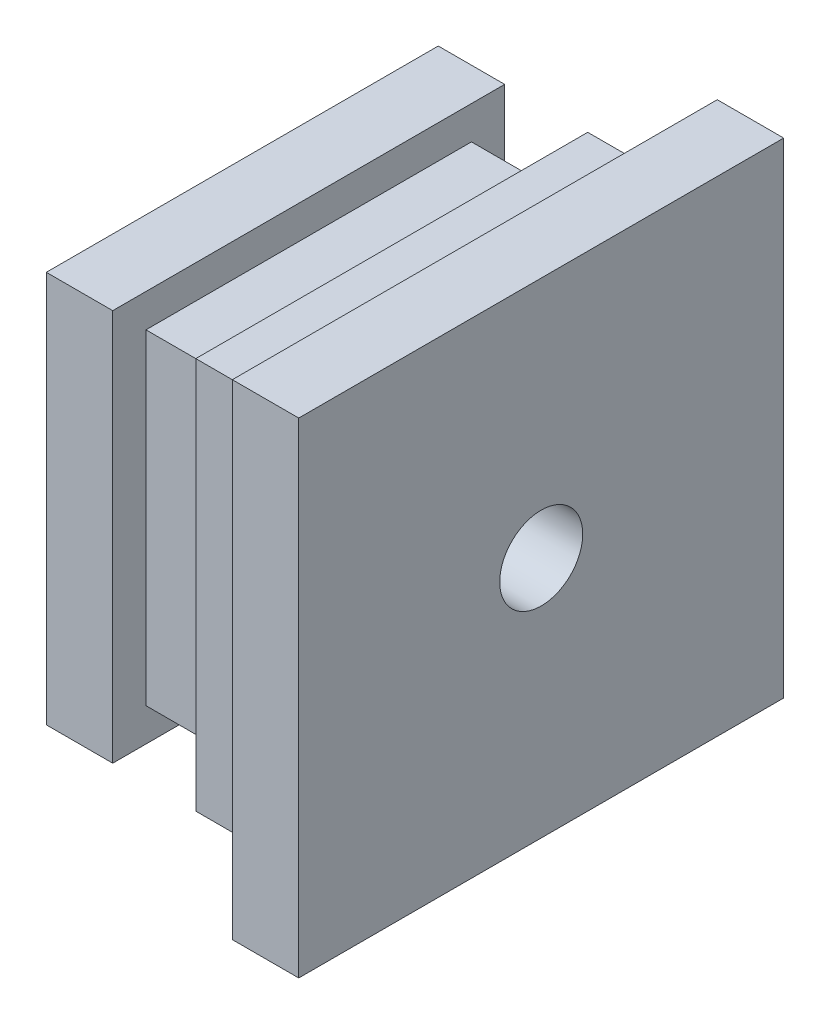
from build123d import *

# Parameters (mm, degrees)
SKETCH_1_W          = 11.8
SKETCH_1_H          = 11.8
EXTRUDE_1_DEPTH     = 8
SKETCH_2_W          = 14.6
SKETCH_2_H          = 14.6
SKETCH_2_W_2        = 11.8
SKETCH_2_H_2        = 11.8
EXTRUDE_2_DEPTH     = 2
SKETCH_4_W          = 11.8
SKETCH_4_H          = 11.8
SKETCH_4_W_2        = 9.8
SKETCH_4_H_2        = 9.8
CUT_EXTRUDE_1_DEPTH = 2
CHAMFER_1_SIZE      = 1
CHAMFER_2_SIZE      = 0.5
SKETCH_5_R          = 1.25
CUT_EXTRUDE_2_DEPTH = 5


with BuildPart() as part:
    # Sketch 1 → Extrude 1 (new body)
    with BuildSketch(Plane(origin=(0, 0, 0), x_dir=(0, 0, -1), z_dir=(1, 0, 0))):
        with Locations((-6.061419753, -1.214814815)):
            Rectangle(SKETCH_1_W, SKETCH_1_H)
    extrude(amount=EXTRUDE_1_DEPTH)

    # Sketch 4 → Cut-Extrude 1 (cut)
    with BuildSketch(Plane.ZY.offset(-5)):
        with Locations((6.061419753, -1.214814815)):
            Rectangle(SKETCH_4_W, SKETCH_4_H)
        with Locations((6.061419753, -1.214814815)):
            Rectangle(SKETCH_4_W_2, SKETCH_4_H_2, mode=Mode.SUBTRACT)
    extrude(amount=CUT_EXTRUDE_1_DEPTH, mode=Mode.SUBTRACT)

    # Chamfer 1
    chamfer_1_edges = [part.edges().sort_by_distance(p)[0] for p in [
        (0, 4.685185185, 6.061419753),
        (0, -1.214814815, 0.161419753),
        (0, -7.114814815, 6.061419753),
        (0, -1.214814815, 11.961419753),
    ]]
    chamfer(chamfer_1_edges, length=CHAMFER_1_SIZE)

    # Chamfer 2
    chamfer_2_edges = [part.edges().sort_by_distance(p)[0] for p in [
        (5, -1.214814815, 0.161419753),
        (5, -7.114814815, 6.061419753),
        (5, -1.214814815, 11.961419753),
        (5, 4.685185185, 6.061419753),
    ]]
    chamfer(chamfer_2_edges, length=CHAMFER_2_SIZE)


with BuildPart() as body_2:
    # Sketch 2 → Extrude 2 (new body)
    # profile 1 of 2: a face of its own
    with BuildSketch(Plane(origin=(8, 0, 0), x_dir=(0, 0, -1), z_dir=(1, 0, 0))):
        with Locations((-6.061419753, -1.214814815)):
            Rectangle(SKETCH_2_W, SKETCH_2_H)
        with Locations((-6.061419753, -1.214814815)):
            Rectangle(SKETCH_2_W_2, SKETCH_2_H_2, mode=Mode.SUBTRACT)
    # profile 2 of 2: a face of its own
    with BuildSketch(Plane(origin=(8, 0, 0), x_dir=(0, 0, -1), z_dir=(1, 0, 0))):
        with Locations((-6.061419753, -1.214814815)):
            Rectangle(SKETCH_2_W_2, SKETCH_2_H_2)
    extrude(amount=EXTRUDE_2_DEPTH)


with BuildPart() as cut_extrude_2_tool:
    # Sketch 5 → Cut-Extrude 2 (new body)
    with BuildSketch(Plane(origin=(10, 0, 0), x_dir=(0, 0, -1), z_dir=(1, 0, 0))):
        with Locations((-6.061419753, -1.214814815)):
            Circle(SKETCH_5_R)
    extrude(amount=-CUT_EXTRUDE_2_DEPTH)


with BuildPart() as part_1:
    add(part.part)

    # Cut-Extrude 2: cut by cut_extrude_2_tool
    add(cut_extrude_2_tool.part, mode=Mode.SUBTRACT)


with BuildPart() as body_2_1:
    add(body_2.part)

    # Cut-Extrude 2: cut by cut_extrude_2_tool
    add(cut_extrude_2_tool.part, mode=Mode.SUBTRACT)


solid = Compound([part_1.part, body_2_1.part])
